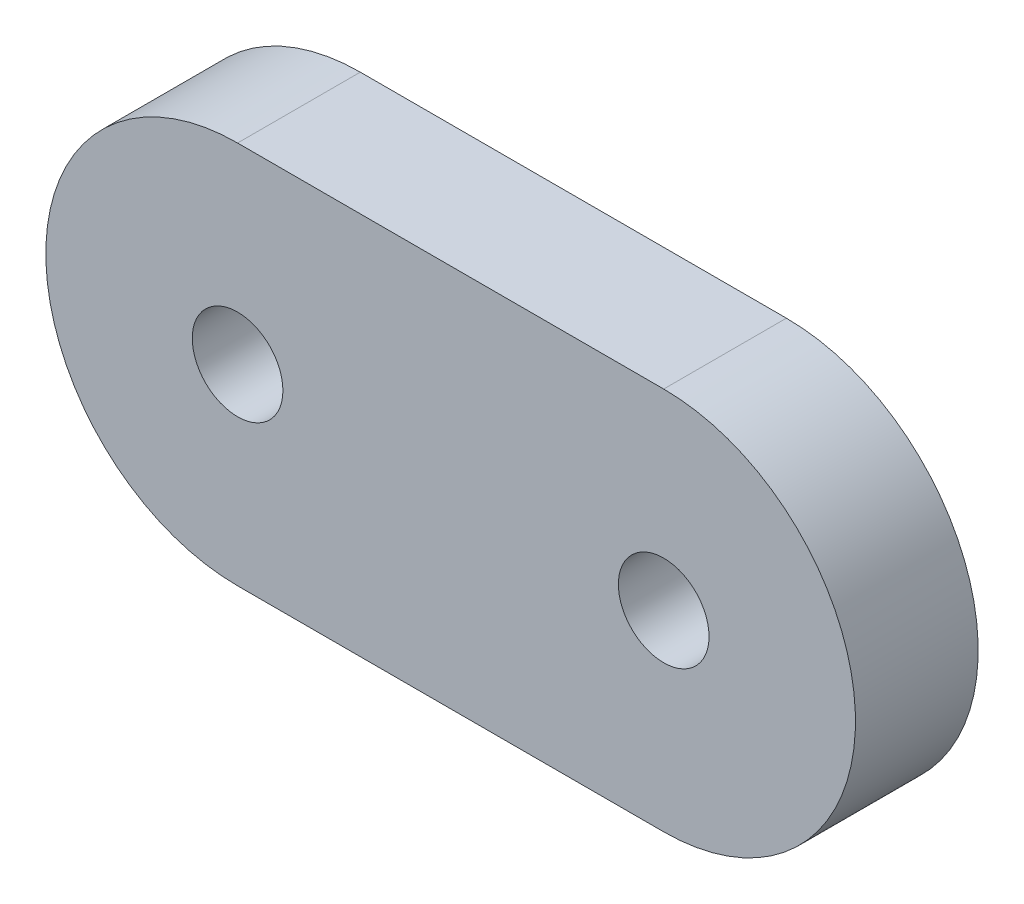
ISO-10303-21;
HEADER;
FILE_DESCRIPTION(('STEP AP214'),'2;1');
FILE_NAME('part.step','',(''),(''),'','','');
FILE_SCHEMA(('AUTOMOTIVE_DESIGN { 1 0 10303 214 1 1 1 1 }'));
ENDSEC;
DATA;
#1=APPLICATION_CONTEXT('core data for automotive mechanical design processes');
#2=APPLICATION_PROTOCOL_DEFINITION('international standard','automotive_design',2000,#1);
#3=PRODUCT_CONTEXT('',#1,'mechanical');
#4=PRODUCT('Part','Part','',(#3));
#5=PRODUCT_RELATED_PRODUCT_CATEGORY('part','',(#4));
#6=PRODUCT_DEFINITION_FORMATION('','',#4);
#7=PRODUCT_DEFINITION_CONTEXT('part definition',#1,'design');
#8=PRODUCT_DEFINITION('design','',#6,#7);
#9=PRODUCT_DEFINITION_SHAPE('','',#8);
#10=(LENGTH_UNIT() NAMED_UNIT(*) SI_UNIT(.MILLI.,.METRE.));
#11=(NAMED_UNIT(*) PLANE_ANGLE_UNIT() SI_UNIT($,.RADIAN.));
#12=(NAMED_UNIT(*) SI_UNIT($,.STERADIAN.) SOLID_ANGLE_UNIT());
#13=UNCERTAINTY_MEASURE_WITH_UNIT(LENGTH_MEASURE(1.E-05),#10,'distance_accuracy_value','');
#14=(GEOMETRIC_REPRESENTATION_CONTEXT(3) GLOBAL_UNCERTAINTY_ASSIGNED_CONTEXT((#13)) GLOBAL_UNIT_ASSIGNED_CONTEXT((#10,
#11,#12)) REPRESENTATION_CONTEXT('',''));
#15=CARTESIAN_POINT('',(0.,0.,0.));
#16=DIRECTION('',(0.,0.,1.));
#17=DIRECTION('',(1.,0.,0.));
#18=AXIS2_PLACEMENT_3D('',#15,#16,#17);
#19=CARTESIAN_POINT('',(-15.875,0.,4.572));
#20=DIRECTION('',(0.,0.,1.));
#21=DIRECTION('',(1.,0.,0.));
#22=AXIS2_PLACEMENT_3D('',#19,#20,#21);
#23=PLANE('',#22);
#24=CARTESIAN_POINT('',(15.875,0.,4.572));
#25=DIRECTION('',(0.,0.,1.));
#26=DIRECTION('',(1.,0.,0.));
#27=AXIS2_PLACEMENT_3D('',#24,#25,#26);
#28=CIRCLE('',#27,3.3782);
#29=CARTESIAN_POINT('',(19.2532,0.,4.572));
#30=VERTEX_POINT('',#29);
#31=EDGE_CURVE('E111',#30,#30,#28,.T.);
#32=ORIENTED_EDGE('',*,*,#31,.F.);
#33=EDGE_LOOP('',(#32));
#34=FACE_BOUND('',#33,.T.);
#35=CARTESIAN_POINT('',(-15.875,0.,4.572));
#36=DIRECTION('',(0.,0.,1.));
#37=DIRECTION('',(1.,0.,0.));
#38=AXIS2_PLACEMENT_3D('',#35,#36,#37);
#39=CIRCLE('',#38,3.3782);
#40=CARTESIAN_POINT('',(-12.4968,0.,4.572));
#41=VERTEX_POINT('',#40);
#42=EDGE_CURVE('E95',#41,#41,#39,.T.);
#43=ORIENTED_EDGE('',*,*,#42,.F.);
#44=EDGE_LOOP('',(#43));
#45=FACE_BOUND('',#44,.T.);
#46=CARTESIAN_POINT('',(-15.875,0.,4.572));
#47=DIRECTION('',(0.,0.,1.));
#48=DIRECTION('',(1.,0.,0.));
#49=AXIS2_PLACEMENT_3D('',#46,#47,#48);
#50=CIRCLE('',#49,14.2875);
#51=CARTESIAN_POINT('',(-15.875,14.2875,4.572));
#52=VERTEX_POINT('',#51);
#53=CARTESIAN_POINT('',(-15.875,-14.2875,4.572));
#54=VERTEX_POINT('',#53);
#55=EDGE_CURVE('E104',#52,#54,#50,.T.);
#56=ORIENTED_EDGE('',*,*,#55,.T.);
#57=DIRECTION('',(1.,0.,0.));
#58=VECTOR('',#57,1.);
#59=CARTESIAN_POINT('',(-15.875,-14.2875,4.572));
#60=LINE('',#59,#58);
#61=CARTESIAN_POINT('',(15.875,-14.2875,4.572));
#62=VERTEX_POINT('',#61);
#63=EDGE_CURVE('E89',#54,#62,#60,.T.);
#64=ORIENTED_EDGE('',*,*,#63,.T.);
#65=CARTESIAN_POINT('',(15.875,0.,4.572));
#66=DIRECTION('',(0.,0.,1.));
#67=DIRECTION('',(1.,0.,0.));
#68=AXIS2_PLACEMENT_3D('',#65,#66,#67);
#69=CIRCLE('',#68,14.2875);
#70=CARTESIAN_POINT('',(15.875,14.2875,4.572));
#71=VERTEX_POINT('',#70);
#72=EDGE_CURVE('E107',#62,#71,#69,.T.);
#73=ORIENTED_EDGE('',*,*,#72,.T.);
#74=DIRECTION('',(-1.,0.,0.));
#75=VECTOR('',#74,1.);
#76=CARTESIAN_POINT('',(15.875,14.2875,4.572));
#77=LINE('',#76,#75);
#78=EDGE_CURVE('E55',#71,#52,#77,.T.);
#79=ORIENTED_EDGE('',*,*,#78,.T.);
#80=EDGE_LOOP('',(#56,#64,#73,#79));
#81=FACE_BOUND('',#80,.T.);
#82=ADVANCED_FACE('F37',(#34,#45,#81),#23,.T.);
#83=CARTESIAN_POINT('',(-15.875,0.,-4.572));
#84=DIRECTION('',(0.,0.,1.));
#85=DIRECTION('',(1.,0.,0.));
#86=AXIS2_PLACEMENT_3D('',#83,#84,#85);
#87=PLANE('',#86);
#88=CARTESIAN_POINT('',(15.875,0.,-4.572));
#89=DIRECTION('',(0.,0.,1.));
#90=DIRECTION('',(1.,0.,0.));
#91=AXIS2_PLACEMENT_3D('',#88,#89,#90);
#92=CIRCLE('',#91,3.3782);
#93=CARTESIAN_POINT('',(19.2532,0.,-4.572));
#94=VERTEX_POINT('',#93);
#95=EDGE_CURVE('E41',#94,#94,#92,.T.);
#96=ORIENTED_EDGE('',*,*,#95,.T.);
#97=EDGE_LOOP('',(#96));
#98=FACE_BOUND('',#97,.T.);
#99=CARTESIAN_POINT('',(-15.875,0.,-4.572));
#100=DIRECTION('',(0.,0.,1.));
#101=DIRECTION('',(1.,0.,0.));
#102=AXIS2_PLACEMENT_3D('',#99,#100,#101);
#103=CIRCLE('',#102,3.3782);
#104=CARTESIAN_POINT('',(-12.4968,0.,-4.572));
#105=VERTEX_POINT('',#104);
#106=EDGE_CURVE('E98',#105,#105,#103,.T.);
#107=ORIENTED_EDGE('',*,*,#106,.T.);
#108=EDGE_LOOP('',(#107));
#109=FACE_BOUND('',#108,.T.);
#110=CARTESIAN_POINT('',(-15.875,0.,-4.572));
#111=DIRECTION('',(0.,0.,1.));
#112=DIRECTION('',(1.,0.,0.));
#113=AXIS2_PLACEMENT_3D('',#110,#111,#112);
#114=CIRCLE('',#113,14.2875);
#115=CARTESIAN_POINT('',(-15.875,14.2875,-4.572));
#116=VERTEX_POINT('',#115);
#117=CARTESIAN_POINT('',(-15.875,-14.2875,-4.572));
#118=VERTEX_POINT('',#117);
#119=EDGE_CURVE('E80',#116,#118,#114,.T.);
#120=ORIENTED_EDGE('',*,*,#119,.F.);
#121=DIRECTION('',(-1.,0.,0.));
#122=VECTOR('',#121,1.);
#123=CARTESIAN_POINT('',(15.875,14.2875,-4.572));
#124=LINE('',#123,#122);
#125=CARTESIAN_POINT('',(15.875,14.2875,-4.572));
#126=VERTEX_POINT('',#125);
#127=EDGE_CURVE('E102',#126,#116,#124,.T.);
#128=ORIENTED_EDGE('',*,*,#127,.F.);
#129=CARTESIAN_POINT('',(15.875,0.,-4.572));
#130=DIRECTION('',(0.,0.,1.));
#131=DIRECTION('',(1.,0.,0.));
#132=AXIS2_PLACEMENT_3D('',#129,#130,#131);
#133=CIRCLE('',#132,14.2875);
#134=CARTESIAN_POINT('',(15.875,-14.2875,-4.572));
#135=VERTEX_POINT('',#134);
#136=EDGE_CURVE('E81',#135,#126,#133,.T.);
#137=ORIENTED_EDGE('',*,*,#136,.F.);
#138=DIRECTION('',(1.,0.,0.));
#139=VECTOR('',#138,1.);
#140=CARTESIAN_POINT('',(-15.875,-14.2875,-4.572));
#141=LINE('',#140,#139);
#142=EDGE_CURVE('E76',#118,#135,#141,.T.);
#143=ORIENTED_EDGE('',*,*,#142,.F.);
#144=EDGE_LOOP('',(#120,#128,#137,#143));
#145=FACE_BOUND('',#144,.T.);
#146=ADVANCED_FACE('F77',(#98,#109,#145),#87,.F.);
#147=CARTESIAN_POINT('',(-15.875,0.,4.572));
#148=DIRECTION('',(0.,0.,-1.));
#149=DIRECTION('',(-1.,0.,0.));
#150=AXIS2_PLACEMENT_3D('',#147,#148,#149);
#151=CYLINDRICAL_SURFACE('',#150,14.2875);
#152=ORIENTED_EDGE('',*,*,#119,.T.);
#153=DIRECTION('',(0.,0.,1.));
#154=VECTOR('',#153,1.);
#155=CARTESIAN_POINT('',(-15.875,-14.2875,4.572));
#156=LINE('',#155,#154);
#157=EDGE_CURVE('E11',#54,#118,#156,.F.);
#158=ORIENTED_EDGE('',*,*,#157,.F.);
#159=ORIENTED_EDGE('',*,*,#55,.F.);
#160=DIRECTION('',(0.,0.,-1.));
#161=VECTOR('',#160,1.);
#162=CARTESIAN_POINT('',(-15.875,14.2875,4.572));
#163=LINE('',#162,#161);
#164=EDGE_CURVE('E94',#52,#116,#163,.T.);
#165=ORIENTED_EDGE('',*,*,#164,.T.);
#166=EDGE_LOOP('',(#152,#158,#159,#165));
#167=FACE_BOUND('',#166,.T.);
#168=ADVANCED_FACE('F93',(#167),#151,.T.);
#169=CARTESIAN_POINT('',(-15.875,-14.2875,4.572));
#170=DIRECTION('',(0.,1.,0.));
#171=DIRECTION('',(0.,0.,1.));
#172=AXIS2_PLACEMENT_3D('',#169,#170,#171);
#173=PLANE('',#172);
#174=ORIENTED_EDGE('',*,*,#142,.T.);
#175=DIRECTION('',(0.,0.,-1.));
#176=VECTOR('',#175,1.);
#177=CARTESIAN_POINT('',(15.875,-14.2875,4.572));
#178=LINE('',#177,#176);
#179=EDGE_CURVE('E47',#62,#135,#178,.T.);
#180=ORIENTED_EDGE('',*,*,#179,.F.);
#181=ORIENTED_EDGE('',*,*,#63,.F.);
#182=ORIENTED_EDGE('',*,*,#157,.T.);
#183=EDGE_LOOP('',(#174,#180,#181,#182));
#184=FACE_BOUND('',#183,.T.);
#185=ADVANCED_FACE('F88',(#184),#173,.F.);
#186=CARTESIAN_POINT('',(15.875,0.,4.572));
#187=DIRECTION('',(0.,0.,-1.));
#188=DIRECTION('',(-1.,0.,0.));
#189=AXIS2_PLACEMENT_3D('',#186,#187,#188);
#190=CYLINDRICAL_SURFACE('',#189,14.2875);
#191=ORIENTED_EDGE('',*,*,#136,.T.);
#192=DIRECTION('',(0.,0.,-1.));
#193=VECTOR('',#192,1.);
#194=CARTESIAN_POINT('',(15.875,14.2875,4.572));
#195=LINE('',#194,#193);
#196=EDGE_CURVE('E120',#71,#126,#195,.T.);
#197=ORIENTED_EDGE('',*,*,#196,.F.);
#198=ORIENTED_EDGE('',*,*,#72,.F.);
#199=ORIENTED_EDGE('',*,*,#179,.T.);
#200=EDGE_LOOP('',(#191,#197,#198,#199));
#201=FACE_BOUND('',#200,.T.);
#202=ADVANCED_FACE('F127',(#201),#190,.T.);
#203=CARTESIAN_POINT('',(15.875,14.2875,4.572));
#204=DIRECTION('',(0.,-1.,0.));
#205=DIRECTION('',(0.,0.,-1.));
#206=AXIS2_PLACEMENT_3D('',#203,#204,#205);
#207=PLANE('',#206);
#208=ORIENTED_EDGE('',*,*,#127,.T.);
#209=ORIENTED_EDGE('',*,*,#164,.F.);
#210=ORIENTED_EDGE('',*,*,#78,.F.);
#211=ORIENTED_EDGE('',*,*,#196,.T.);
#212=EDGE_LOOP('',(#208,#209,#210,#211));
#213=FACE_BOUND('',#212,.T.);
#214=ADVANCED_FACE('F39',(#213),#207,.F.);
#215=CARTESIAN_POINT('',(-15.875,0.,-8.128));
#216=DIRECTION('',(0.,0.,1.));
#217=DIRECTION('',(1.,0.,0.));
#218=AXIS2_PLACEMENT_3D('',#215,#216,#217);
#219=CYLINDRICAL_SURFACE('',#218,3.3782);
#220=ORIENTED_EDGE('',*,*,#42,.T.);
#221=EDGE_LOOP('',(#220));
#222=FACE_BOUND('',#221,.T.);
#223=ORIENTED_EDGE('',*,*,#106,.F.);
#224=EDGE_LOOP('',(#223));
#225=FACE_BOUND('',#224,.T.);
#226=ADVANCED_FACE('F138',(#222,#225),#219,.F.);
#227=CARTESIAN_POINT('',(15.875,0.,-8.128));
#228=DIRECTION('',(0.,0.,1.));
#229=DIRECTION('',(1.,0.,0.));
#230=AXIS2_PLACEMENT_3D('',#227,#228,#229);
#231=CYLINDRICAL_SURFACE('',#230,3.3782);
#232=ORIENTED_EDGE('',*,*,#31,.T.);
#233=EDGE_LOOP('',(#232));
#234=FACE_BOUND('',#233,.T.);
#235=ORIENTED_EDGE('',*,*,#95,.F.);
#236=EDGE_LOOP('',(#235));
#237=FACE_BOUND('',#236,.T.);
#238=ADVANCED_FACE('F172',(#234,#237),#231,.F.);
#239=CLOSED_SHELL('',(#82,#146,#168,#185,#202,#214,#226,#238));
#240=MANIFOLD_SOLID_BREP('B2',#239);
#241=ADVANCED_BREP_SHAPE_REPRESENTATION('',(#18,#240),#14);
#242=SHAPE_DEFINITION_REPRESENTATION(#9,#241);
ENDSEC;
END-ISO-10303-21;
